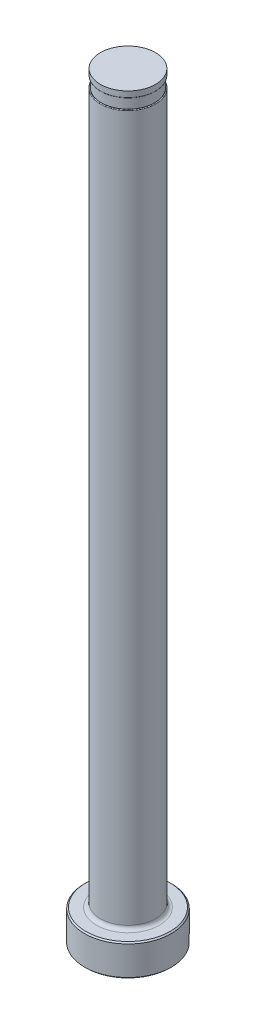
from build123d import *

# Parameters (mm, degrees)
CHAMFER1_SIZE     = 0.254
FILLET1_R         = 0.762
SKETCH2_W         = 0.2032
SKETCH2_H         = 2.032
D_SLOT_DEPTH      = 153.898684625
D_SLOT_DEPTH_BACK = 153.898684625
SKETCH5_W         = 0.01905
SKETCH5_H         = 1.27
FILLET2_R         = 0.127


with BuildPart() as part:
    # Sketch1 → Revolve1 (revolve)
    with BuildSketch(Plane.XY, mode=Mode.PRIVATE) as revolve1_sk:
        Polygon((0, 0), (-8.7249, 0), (-8.7249, 6.35), (-5.55625, 6.35), (-5.55625, 152.4), (0, 152.4), align=None)
    revolve(revolve1_sk.sketch.rotate(Axis((0, 259.958771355, 0), (0, -1, 0)), 270), axis=Axis((0, 259.958771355, 0), (0, -1, 0)))

    # Chamfer1
    chamfer1_edges = [part.edges().sort_by_distance(p)[0] for p in [
        (0, 6.35, -8.7249),
        (0, 0, -8.7249),
    ]]
    chamfer(chamfer1_edges, length=CHAMFER1_SIZE)

    # Fillet1
    fillet1_edges = [part.edges().sort_by_distance(p)[0] for p in [
        (0, 6.35, -5.55625),
    ]]
    fillet(fillet1_edges, radius=FILLET1_R)

    # Sketch2 → Vent Relief (revolve, cut)
    with BuildSketch(Plane.XY, mode=Mode.PRIVATE) as vent_relief_sk:
        with Locations((-5.45465, 150.114)):
            Rectangle(SKETCH2_W, SKETCH2_H)
    revolve(vent_relief_sk.sketch.rotate(Axis((0, 153.448281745, 0), (0, -1, 0)), 270), axis=Axis((0, 153.448281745, 0), (0, -1, 0)), mode=Mode.SUBTRACT)

    # Sketch3 → D-Slot (cut, two sides: drawn at the far end of the back side and taken through both)
    with BuildSketch(Plane.XY.offset(-D_SLOT_DEPTH_BACK)):
        with BuildLine():
            Line((-5.35305, 150.114), (-5.35305, 86.614))
            ThreePointArc((-5.35305, 86.614), (-5.404263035, 86.046038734), (-5.55625, 85.4964))
            Line((-5.55625, 85.4964), (-5.55625, 150.114))
            Line((-5.55625, 150.114), (-5.35305, 150.114))
        make_face()
    extrude(amount=D_SLOT_DEPTH + D_SLOT_DEPTH_BACK, mode=Mode.SUBTRACT)

    # Sketch5 → Vent Diameter (revolve, cut)
    with BuildSketch(Plane.XY, mode=Mode.PRIVATE) as vent_diameter_sk:
        with Locations((-5.546725, 151.765)):
            Rectangle(SKETCH5_W, SKETCH5_H)
    revolve(vent_diameter_sk.sketch.rotate(Axis((0, 152.687735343, 0), (0, -1, 0)), 90), axis=Axis((0, 152.687735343, 0), (0, -1, 0)), mode=Mode.SUBTRACT)

    # Fillet2
    fillet2_edges = [part.edges().sort_by_distance(p)[0] for p in [
        (4.424054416, 149.098, -3.361496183),
        (0, 151.13, 5.5372),
    ]]
    fillet(fillet2_edges, radius=FILLET2_R)


solid = part.part
